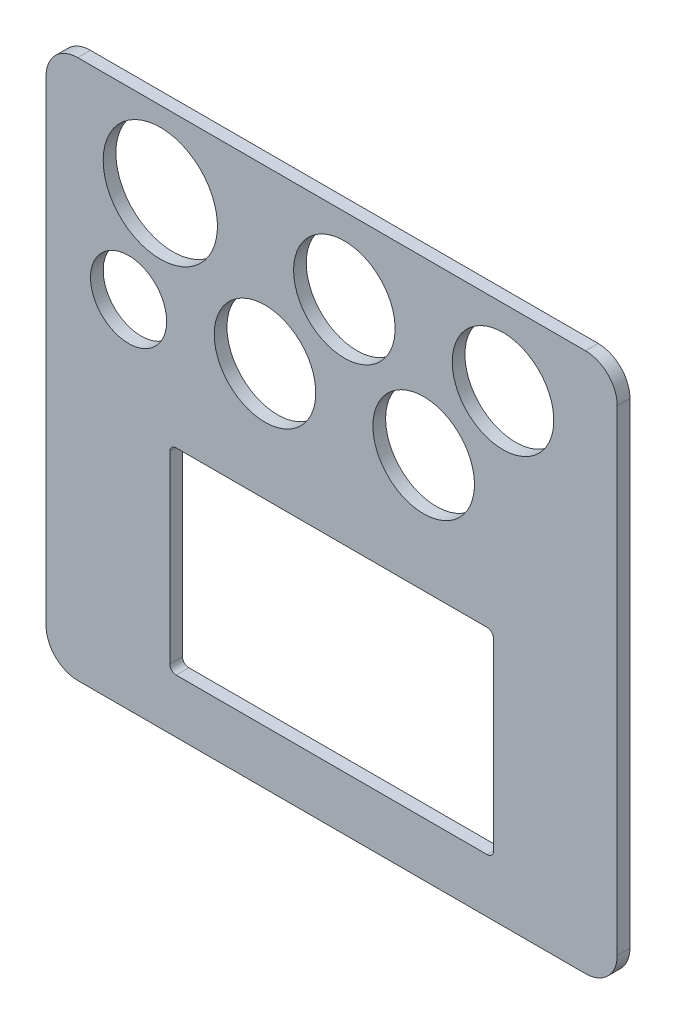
from build123d import *

# Parameters (mm, degrees)
EXTRUDE_1_DEPTH     = 2
SKETCH_5_W          = 55
SKETCH_5_H          = 3
EXTRUDE_2_DEPTH     = 0.01
SKETCH_6_W          = 51
SKETCH_6_H          = 31
CUT_EXTRUDE_3_DEPTH = 62.929395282
FILLET_1_R          = 1
SKETCH_8_R          = 8
SKETCH_8_R_2        = 9
CUT_EXTRUDE_4_DEPTH = 62.929395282
SKETCH_9_R          = 6
CUT_EXTRUDE_5_DEPTH = 2


with BuildPart() as part:
    # Sketch 1 → Extrude 1 (new body)
    with BuildSketch(Plane.XY):
        with BuildLine():
            Line((-40, 42.5), (40, 42.5))
            ThreePointArc((40, 42.5), (43.535533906, 41.035533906), (45, 37.5))
            Line((45, 37.5), (45, -37.5))
            ThreePointArc((45, -37.5), (43.535533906, -41.035533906), (40, -42.5))
            Line((40, -42.5), (-40, -42.5))
            ThreePointArc((-40, -42.5), (-43.535533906, -41.035533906), (-45, -37.5))
            Line((-45, -37.5), (-45, 37.5))
            ThreePointArc((-45, 37.5), (-43.535533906, 41.035533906), (-40, 42.5))
        make_face()
    extrude(amount=EXTRUDE_1_DEPTH)

    # Sketch 5 → Extrude 2 (add)
    with BuildSketch(Plane(origin=(0, 0, 0), x_dir=(-1, 0, 0), z_dir=(0, 0, -1))):
        with Locations((0, -37.5)):
            Rectangle(SKETCH_5_W, SKETCH_5_H)
        with Locations((0, 0.5)):
            Rectangle(SKETCH_5_W, SKETCH_5_H)
    extrude(amount=EXTRUDE_2_DEPTH)

    # Sketch 6 → Cut-Extrude 3 (cut, through all)
    with BuildSketch(Plane(origin=(0, 0, 0), x_dir=(-1, 0, 0), z_dir=(0, 0, -1))):
        with Locations((0, -18.5)):
            Rectangle(SKETCH_6_W, SKETCH_6_H)
    extrude(amount=-CUT_EXTRUDE_3_DEPTH, mode=Mode.SUBTRACT)

    # Fillet 1
    fillet_1_edges = [part.edges().sort_by_distance(p)[0] for p in [
        (-25.5, -3, 1),
        (-25.5, -34, 1),
        (25.5, -34, 1),
        (25.5, -3, 1),
    ]]
    fillet(fillet_1_edges, radius=FILLET_1_R)

    # Sketch 8 → Cut-Extrude 4 (cut, through all)
    with BuildSketch(Plane(origin=(0, 0, 0), x_dir=(-1, 0, 0), z_dir=(0, 0, -1))):
        with Locations((-27, 30.5)):
            Circle(SKETCH_8_R)
        with Locations((-14.5, 15.5)):
            Circle(SKETCH_8_R)
        with Locations((-2, 30.5)):
            Circle(SKETCH_8_R)
        with Locations((10.5, 15.5)):
            Circle(SKETCH_8_R)
        with Locations((27, 30.5)):
            Circle(SKETCH_8_R_2)
    extrude(amount=-CUT_EXTRUDE_4_DEPTH, mode=Mode.SUBTRACT)

    # Sketch 9 → Cut-Extrude 5 (cut)
    with BuildSketch(Plane.XY.offset(2)):
        with Locations((-32, 13.5)):
            Circle(SKETCH_9_R)
    extrude(amount=-CUT_EXTRUDE_5_DEPTH, mode=Mode.SUBTRACT)


solid = part.part
